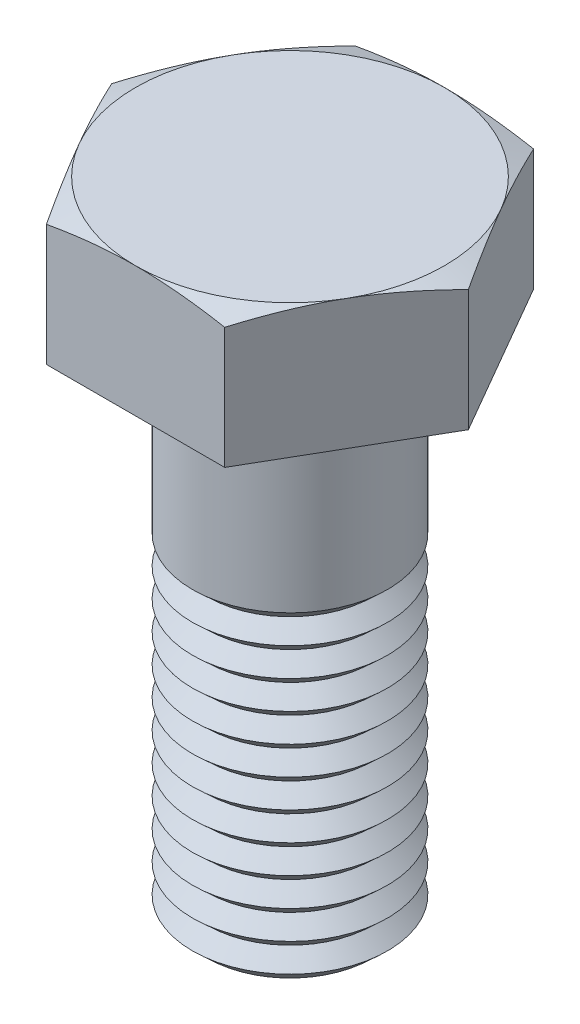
ISO-10303-21;
HEADER;
FILE_DESCRIPTION(('STEP AP214'),'2;1');
FILE_NAME('part.step','',(''),(''),'','','');
FILE_SCHEMA(('AUTOMOTIVE_DESIGN { 1 0 10303 214 1 1 1 1 }'));
ENDSEC;
DATA;
#1=APPLICATION_CONTEXT('core data for automotive mechanical design processes');
#2=APPLICATION_PROTOCOL_DEFINITION('international standard','automotive_design',2000,#1);
#3=PRODUCT_CONTEXT('',#1,'mechanical');
#4=PRODUCT('Part','Part','',(#3));
#5=PRODUCT_RELATED_PRODUCT_CATEGORY('part','',(#4));
#6=PRODUCT_DEFINITION_FORMATION('','',#4);
#7=PRODUCT_DEFINITION_CONTEXT('part definition',#1,'design');
#8=PRODUCT_DEFINITION('design','',#6,#7);
#9=PRODUCT_DEFINITION_SHAPE('','',#8);
#10=(LENGTH_UNIT() NAMED_UNIT(*) SI_UNIT(.MILLI.,.METRE.));
#11=(NAMED_UNIT(*) PLANE_ANGLE_UNIT() SI_UNIT($,.RADIAN.));
#12=(NAMED_UNIT(*) SI_UNIT($,.STERADIAN.) SOLID_ANGLE_UNIT());
#13=UNCERTAINTY_MEASURE_WITH_UNIT(LENGTH_MEASURE(1.E-05),#10,'distance_accuracy_value','');
#14=(GEOMETRIC_REPRESENTATION_CONTEXT(3) GLOBAL_UNCERTAINTY_ASSIGNED_CONTEXT((#13)) GLOBAL_UNIT_ASSIGNED_CONTEXT((#10,
#11,#12)) REPRESENTATION_CONTEXT('',''));
#15=CARTESIAN_POINT('',(0.,0.,0.));
#16=DIRECTION('',(0.,0.,1.));
#17=DIRECTION('',(1.,0.,0.));
#18=AXIS2_PLACEMENT_3D('',#15,#16,#17);
#19=CARTESIAN_POINT('',(16.4544826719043,-8.,-9.5));
#20=DIRECTION('',(0.,1.,0.));
#21=DIRECTION('',(0.,0.,1.));
#22=AXIS2_PLACEMENT_3D('',#19,#20,#21);
#23=PLANE('',#22);
#24=DIRECTION('',(0.5,0.,-0.866025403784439));
#25=VECTOR('',#24,1.);
#26=CARTESIAN_POINT('',(5.48482755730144,-8.,9.5));
#27=LINE('',#26,#25);
#28=CARTESIAN_POINT('',(5.48482755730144,-8.,9.5));
#29=VERTEX_POINT('',#28);
#30=CARTESIAN_POINT('',(10.9696551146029,-8.,0.));
#31=VERTEX_POINT('',#30);
#32=EDGE_CURVE('E165',#29,#31,#27,.T.);
#33=ORIENTED_EDGE('',*,*,#32,.F.);
#34=DIRECTION('',(1.,0.,0.));
#35=VECTOR('',#34,1.);
#36=CARTESIAN_POINT('',(-5.48482755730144,-8.,9.5));
#37=LINE('',#36,#35);
#38=CARTESIAN_POINT('',(-5.48482755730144,-8.,9.5));
#39=VERTEX_POINT('',#38);
#40=EDGE_CURVE('E180',#39,#29,#37,.T.);
#41=ORIENTED_EDGE('',*,*,#40,.F.);
#42=DIRECTION('',(0.5,0.,0.866025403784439));
#43=VECTOR('',#42,1.);
#44=CARTESIAN_POINT('',(-10.9696551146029,-8.,0.));
#45=LINE('',#44,#43);
#46=CARTESIAN_POINT('',(-10.9696551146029,-8.,0.));
#47=VERTEX_POINT('',#46);
#48=EDGE_CURVE('E177',#47,#39,#45,.T.);
#49=ORIENTED_EDGE('',*,*,#48,.F.);
#50=DIRECTION('',(-0.5,0.,0.866025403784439));
#51=VECTOR('',#50,1.);
#52=CARTESIAN_POINT('',(-5.48482755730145,-8.,-9.5));
#53=LINE('',#52,#51);
#54=CARTESIAN_POINT('',(-5.48482755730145,-8.,-9.5));
#55=VERTEX_POINT('',#54);
#56=EDGE_CURVE('E174',#55,#47,#53,.T.);
#57=ORIENTED_EDGE('',*,*,#56,.F.);
#58=DIRECTION('',(-1.,0.,0.));
#59=VECTOR('',#58,1.);
#60=CARTESIAN_POINT('',(5.48482755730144,-8.,-9.5));
#61=LINE('',#60,#59);
#62=CARTESIAN_POINT('',(5.48482755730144,-8.,-9.5));
#63=VERTEX_POINT('',#62);
#64=EDGE_CURVE('E171',#63,#55,#61,.T.);
#65=ORIENTED_EDGE('',*,*,#64,.F.);
#66=DIRECTION('',(-0.5,0.,-0.866025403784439));
#67=VECTOR('',#66,1.);
#68=CARTESIAN_POINT('',(10.9696551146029,-8.,0.));
#69=LINE('',#68,#67);
#70=EDGE_CURVE('E168',#31,#63,#69,.T.);
#71=ORIENTED_EDGE('',*,*,#70,.F.);
#72=EDGE_LOOP('',(#33,#41,#49,#57,#65,#71));
#73=FACE_BOUND('',#72,.T.);
#74=CARTESIAN_POINT('',(0.,-8.,0.));
#75=DIRECTION('',(0.,1.,0.));
#76=DIRECTION('',(0.,0.,1.));
#77=AXIS2_PLACEMENT_3D('',#74,#75,#76);
#78=CIRCLE('',#77,6.);
#79=CARTESIAN_POINT('',(0.,-8.,6.));
#80=VERTEX_POINT('',#79);
#81=EDGE_CURVE('E11',#80,#80,#78,.F.);
#82=ORIENTED_EDGE('',*,*,#81,.F.);
#83=EDGE_LOOP('',(#82));
#84=FACE_BOUND('',#83,.T.);
#85=ADVANCED_FACE('F33',(#73,#84),#23,.F.);
#86=CARTESIAN_POINT('',(5.48482755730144,-8.,9.5));
#87=DIRECTION('',(0.866025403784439,0.,0.5));
#88=DIRECTION('',(0.5,0.,-0.866025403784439));
#89=AXIS2_PLACEMENT_3D('',#86,#87,#88);
#90=PLANE('',#89);
#91=CARTESIAN_POINT('',(5.48471208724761,-0.53495274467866,9.5002));
#92=CARTESIAN_POINT('',(5.71186037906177,-0.452247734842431,9.10676761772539));
#93=CARTESIAN_POINT('',(5.93975769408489,-0.377013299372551,8.71203788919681));
#94=CARTESIAN_POINT('',(6.39703409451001,-0.244650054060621,7.9200119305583));
#95=CARTESIAN_POINT('',(6.62641419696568,-0.187535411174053,7.52271393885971));
#96=CARTESIAN_POINT('',(7.08411065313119,-0.0951541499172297,6.72996042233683));
#97=CARTESIAN_POINT('',(7.31241655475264,-0.059686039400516,6.33452300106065));
#98=CARTESIAN_POINT('',(7.76956223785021,-0.0121133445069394,5.54272345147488));
#99=CARTESIAN_POINT('',(7.99840178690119,0.,5.14636172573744));
#100=CARTESIAN_POINT('',(8.45608088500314,0.,4.35363827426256));
#101=CARTESIAN_POINT('',(8.68492043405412,-0.0121133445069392,3.95727654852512));
#102=CARTESIAN_POINT('',(9.14206611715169,-0.0596860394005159,3.16547699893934));
#103=CARTESIAN_POINT('',(9.37037201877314,-0.09515414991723,2.77003957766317));
#104=CARTESIAN_POINT('',(9.82806847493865,-0.187535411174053,1.97728606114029));
#105=CARTESIAN_POINT('',(10.0574485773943,-0.244650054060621,1.5799880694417));
#106=CARTESIAN_POINT('',(10.5147249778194,-0.377013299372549,0.787962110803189));
#107=CARTESIAN_POINT('',(10.7426222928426,-0.452247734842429,0.393232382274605));
#108=CARTESIAN_POINT('',(10.9697705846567,-0.534952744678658,-0.000200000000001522));
#109=B_SPLINE_CURVE_WITH_KNOTS('',3,(#91,#92,#93,#94,#95,#96,#97,#98,#99,#100,#101,#102,#103,
#104,#105,#106,#107,#108),.UNSPECIFIED.,.F.,.F.,(4,2,2,2,2,2,2,2,4),(0.,1.38543330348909,
2.7719471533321,4.14534984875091,5.51823729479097,6.89112474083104,8.26452743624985,
9.65104128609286,11.0364745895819),.UNSPECIFIED.);
#110=CARTESIAN_POINT('',(5.48482755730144,-0.534910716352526,9.5));
#111=VERTEX_POINT('',#110);
#112=CARTESIAN_POINT('',(8.22724133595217,0.,4.75));
#113=VERTEX_POINT('',#112);
#114=EDGE_CURVE('E223',#111,#113,#109,.T.);
#115=ORIENTED_EDGE('',*,*,#114,.F.);
#116=DIRECTION('',(0.,1.,0.));
#117=VECTOR('',#116,1.);
#118=CARTESIAN_POINT('',(5.48482755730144,-8.,9.5));
#119=LINE('',#118,#117);
#120=EDGE_CURVE('E184',#29,#111,#119,.T.);
#121=ORIENTED_EDGE('',*,*,#120,.F.);
#122=ORIENTED_EDGE('',*,*,#32,.T.);
#123=DIRECTION('',(0.,1.,0.));
#124=VECTOR('',#123,1.);
#125=CARTESIAN_POINT('',(10.9696551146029,-8.,0.));
#126=LINE('',#125,#124);
#127=CARTESIAN_POINT('',(10.9696551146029,-0.534910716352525,0.));
#128=VERTEX_POINT('',#127);
#129=EDGE_CURVE('E183',#31,#128,#126,.T.);
#130=ORIENTED_EDGE('',*,*,#129,.T.);
#131=EDGE_CURVE('E225',#113,#128,#109,.T.);
#132=ORIENTED_EDGE('',*,*,#131,.F.);
#133=EDGE_LOOP('',(#115,#121,#122,#130,#132));
#134=FACE_BOUND('',#133,.T.);
#135=ADVANCED_FACE('F35',(#134),#90,.T.);
#136=CARTESIAN_POINT('',(-5.48482755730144,-8.,9.5));
#137=DIRECTION('',(0.,0.,1.));
#138=DIRECTION('',(1.,0.,0.));
#139=AXIS2_PLACEMENT_3D('',#136,#137,#138);
#140=PLANE('',#139);
#141=CARTESIAN_POINT('',(-14.5419416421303,-2.86445796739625,9.5));
#142=CARTESIAN_POINT('',(-14.111908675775,-2.73345890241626,9.5));
#143=CARTESIAN_POINT('',(-13.6814027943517,-2.60398402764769,9.5));
#144=CARTESIAN_POINT('',(-12.8192043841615,-2.34892580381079,9.5));
#145=CARTESIAN_POINT('',(-12.387511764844,-2.22334276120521,9.5));
#146=CARTESIAN_POINT('',(-11.521965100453,-1.97670381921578,9.5));
#147=CARTESIAN_POINT('',(-11.0881085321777,-1.85565674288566,9.5));
#148=CARTESIAN_POINT('',(-10.2187842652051,-1.61950158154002,9.5));
#149=CARTESIAN_POINT('',(-9.78331659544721,-1.50439339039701,9.5));
#150=CARTESIAN_POINT('',(-8.91584902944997,-1.28295767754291,9.5));
#151=CARTESIAN_POINT('',(-8.48387237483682,-1.17653955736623,9.5));
#152=CARTESIAN_POINT('',(-7.6177717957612,-0.972733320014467,9.5));
#153=CARTESIAN_POINT('',(-7.18364783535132,-0.875345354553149,9.5));
#154=CARTESIAN_POINT('',(-6.31315143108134,-0.691863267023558,9.5));
#155=CARTESIAN_POINT('',(-5.87677978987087,-0.605765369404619,9.5));
#156=CARTESIAN_POINT('',(-5.00150208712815,-0.44747954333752,9.5));
#157=CARTESIAN_POINT('',(-4.56259611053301,-0.375291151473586,9.5));
#158=CARTESIAN_POINT('',(-3.73163054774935,-0.254897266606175,9.5));
#159=CARTESIAN_POINT('',(-3.33983139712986,-0.204910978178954,9.5));
#160=CARTESIAN_POINT('',(-2.55457029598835,-0.120228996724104,9.5));
#161=CARTESIAN_POINT('',(-2.16110839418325,-0.0855328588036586,9.5));
#162=CARTESIAN_POINT('',(-1.37332015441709,-0.0331017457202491,9.5));
#163=CARTESIAN_POINT('',(-0.978994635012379,-0.015354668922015,9.5));
#164=CARTESIAN_POINT('',(-0.189940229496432,0.00227934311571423,9.5));
#165=CARTESIAN_POINT('',(0.204788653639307,0.00216640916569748,9.5));
#166=CARTESIAN_POINT('',(0.99583170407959,-0.0159594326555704,9.5));
#167=CARTESIAN_POINT('',(1.3921437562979,-0.0340631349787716,9.5));
#168=CARTESIAN_POINT('',(2.18360912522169,-0.087337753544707,9.5));
#169=CARTESIAN_POINT('',(2.57876241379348,-0.122509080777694,9.5));
#170=CARTESIAN_POINT('',(3.36771357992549,-0.208269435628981,9.5));
#171=CARTESIAN_POINT('',(3.76150999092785,-0.25887176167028,9.5));
#172=CARTESIAN_POINT('',(4.5471326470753,-0.373435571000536,9.5));
#173=CARTESIAN_POINT('',(4.93895888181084,-0.437397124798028,9.5));
#174=CARTESIAN_POINT('',(5.74225885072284,-0.580450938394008,9.5));
#175=CARTESIAN_POINT('',(6.15361717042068,-0.660185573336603,9.5));
#176=CARTESIAN_POINT('',(6.97421437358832,-0.829964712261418,9.5));
#177=CARTESIAN_POINT('',(7.38345309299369,-0.920010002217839,9.5));
#178=CARTESIAN_POINT('',(8.20010488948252,-1.10850683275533,9.5));
#179=CARTESIAN_POINT('',(8.60751739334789,-1.20696084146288,9.5));
#180=CARTESIAN_POINT('',(9.4206212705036,-1.4106638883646,9.5));
#181=CARTESIAN_POINT('',(9.82631268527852,-1.51591276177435,9.5));
#182=CARTESIAN_POINT('',(10.6367432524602,-1.73207211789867,9.5));
#183=CARTESIAN_POINT('',(11.041480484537,-1.84298977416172,9.5));
#184=CARTESIAN_POINT('',(11.8496881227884,-2.06934217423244,9.5));
#185=CARTESIAN_POINT('',(12.253158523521,-2.18477693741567,9.5));
#186=CARTESIAN_POINT('',(13.0589479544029,-2.41933287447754,9.5));
#187=CARTESIAN_POINT('',(13.4612671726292,-2.53845340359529,9.5));
#188=CARTESIAN_POINT('',(14.2649852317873,-2.77976340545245,9.5));
#189=CARTESIAN_POINT('',(14.6663840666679,-2.90195289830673,9.5));
#190=CARTESIAN_POINT('',(15.8605690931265,-3.26960931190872,9.5));
#191=CARTESIAN_POINT('',(16.6522166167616,-3.51877398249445,9.5));
#192=CARTESIAN_POINT('',(18.2332882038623,-4.02415555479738,9.5));
#193=CARTESIAN_POINT('',(19.0227121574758,-4.28037279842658,9.5));
#194=CARTESIAN_POINT('',(20.5968461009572,-4.79698600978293,9.5));
#195=CARTESIAN_POINT('',(21.3815625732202,-5.05736225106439,9.5));
#196=CARTESIAN_POINT('',(22.5576353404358,-5.45080826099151,9.5));
#197=CARTESIAN_POINT('',(22.9494767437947,-5.58243181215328,9.5));
#198=CARTESIAN_POINT('',(23.7328721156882,-5.8465285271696,9.5));
#199=CARTESIAN_POINT('',(24.1244260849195,-5.9790016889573,9.5));
#200=CARTESIAN_POINT('',(24.5158552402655,-6.11184281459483,9.5));
#201=B_SPLINE_CURVE_WITH_KNOTS('',3,(#141,#142,#143,#144,#145,#146,#147,#148,#149,#150,#151,
#152,#153,#154,#155,#156,#157,#158,#159,#160,#161,#162,#163,#164,#165,#166,#167,#168,#169,#170,
#171,#172,#173,#174,#175,#176,#177,#178,#179,#180,#181,#182,#183,#184,#185,#186,#187,#188,#189,
#190,#191,#192,#193,#194,#195,#196,#197,#198,#199,#200),.UNSPECIFIED.,.F.,.F.,(4,2,2,2,2,2,2,2,
2,2,2,2,2,2,2,2,2,2,2,2,2,2,2,2,2,2,2,2,2,4),(0.,1.34863916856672,2.69738426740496,
4.04862941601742,5.39985040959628,6.73444889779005,8.06906980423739,9.40324325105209,
10.7373722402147,11.9220374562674,13.1066682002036,14.2904524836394,15.4742280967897,
16.6640083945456,17.8538173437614,19.0446545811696,20.2354981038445,21.4923798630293,
22.7493574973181,24.0067053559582,25.2640227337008,26.5229726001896,27.7819278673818,
29.0406641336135,30.2994086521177,32.789153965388,35.2790201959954,37.7593650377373,
38.9994369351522,40.2395058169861),.UNSPECIFIED.);
#202=CARTESIAN_POINT('',(-5.48482755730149,-0.534910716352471,9.5));
#203=VERTEX_POINT('',#202);
#204=CARTESIAN_POINT('',(0.,0.,9.5));
#205=VERTEX_POINT('',#204);
#206=EDGE_CURVE('E154',#203,#205,#201,.T.);
#207=ORIENTED_EDGE('',*,*,#206,.F.);
#208=DIRECTION('',(0.,1.,0.));
#209=VECTOR('',#208,1.);
#210=CARTESIAN_POINT('',(-5.48482755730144,-8.,9.5));
#211=LINE('',#210,#209);
#212=EDGE_CURVE('E188',#39,#203,#211,.T.);
#213=ORIENTED_EDGE('',*,*,#212,.F.);
#214=ORIENTED_EDGE('',*,*,#40,.T.);
#215=ORIENTED_EDGE('',*,*,#120,.T.);
#216=EDGE_CURVE('E148',#205,#111,#201,.T.);
#217=ORIENTED_EDGE('',*,*,#216,.F.);
#218=EDGE_LOOP('',(#207,#213,#214,#215,#217));
#219=FACE_BOUND('',#218,.T.);
#220=ADVANCED_FACE('F125',(#219),#140,.T.);
#221=CARTESIAN_POINT('',(-10.9696551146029,-8.,0.));
#222=DIRECTION('',(-0.866025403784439,0.,0.5));
#223=DIRECTION('',(0.5,0.,0.866025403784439));
#224=AXIS2_PLACEMENT_3D('',#221,#222,#223);
#225=PLANE('',#224);
#226=CARTESIAN_POINT('',(-10.9697705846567,-0.534952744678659,-0.000199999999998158));
#227=CARTESIAN_POINT('',(-10.7426222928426,-0.45224773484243,0.393232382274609));
#228=CARTESIAN_POINT('',(-10.5147249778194,-0.37701329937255,0.787962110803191));
#229=CARTESIAN_POINT('',(-10.0574485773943,-0.244650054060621,1.5799880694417));
#230=CARTESIAN_POINT('',(-9.82806847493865,-0.187535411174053,1.97728606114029));
#231=CARTESIAN_POINT('',(-9.37037201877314,-0.0951541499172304,2.77003957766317));
#232=CARTESIAN_POINT('',(-9.14206611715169,-0.0596860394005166,3.16547699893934));
#233=CARTESIAN_POINT('',(-8.68492043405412,-0.01211334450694,3.95727654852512));
#234=CARTESIAN_POINT('',(-8.45608088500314,0.,4.35363827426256));
#235=CARTESIAN_POINT('',(-7.99840178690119,0.,5.14636172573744));
#236=CARTESIAN_POINT('',(-7.76956223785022,-0.01211334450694,5.54272345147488));
#237=CARTESIAN_POINT('',(-7.31241655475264,-0.0596860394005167,6.33452300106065));
#238=CARTESIAN_POINT('',(-7.08411065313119,-0.0951541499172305,6.72996042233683));
#239=CARTESIAN_POINT('',(-6.62641419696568,-0.187535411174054,7.52271393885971));
#240=CARTESIAN_POINT('',(-6.39703409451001,-0.244650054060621,7.9200119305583));
#241=CARTESIAN_POINT('',(-5.93975769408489,-0.37701329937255,8.71203788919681));
#242=CARTESIAN_POINT('',(-5.71186037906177,-0.45224773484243,9.10676761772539));
#243=CARTESIAN_POINT('',(-5.48471208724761,-0.534952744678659,9.5002));
#244=B_SPLINE_CURVE_WITH_KNOTS('',3,(#226,#227,#228,#229,#230,#231,#232,#233,#234,#235,#236,
#237,#238,#239,#240,#241,#242,#243),.UNSPECIFIED.,.F.,.F.,(4,2,2,2,2,2,2,2,4),(0.,
1.38543330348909,2.7719471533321,4.14534984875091,5.51823729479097,6.89112474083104,
8.26452743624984,9.65104128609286,11.0364745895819),.UNSPECIFIED.);
#245=CARTESIAN_POINT('',(-10.9696551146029,-0.534910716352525,0.));
#246=VERTEX_POINT('',#245);
#247=CARTESIAN_POINT('',(-8.22724133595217,0.,4.75));
#248=VERTEX_POINT('',#247);
#249=EDGE_CURVE('E49',#246,#248,#244,.T.);
#250=ORIENTED_EDGE('',*,*,#249,.F.);
#251=DIRECTION('',(0.,1.,0.));
#252=VECTOR('',#251,1.);
#253=CARTESIAN_POINT('',(-10.9696551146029,-8.,0.));
#254=LINE('',#253,#252);
#255=EDGE_CURVE('E191',#47,#246,#254,.T.);
#256=ORIENTED_EDGE('',*,*,#255,.F.);
#257=ORIENTED_EDGE('',*,*,#48,.T.);
#258=ORIENTED_EDGE('',*,*,#212,.T.);
#259=EDGE_CURVE('E159',#248,#203,#244,.T.);
#260=ORIENTED_EDGE('',*,*,#259,.F.);
#261=EDGE_LOOP('',(#250,#256,#257,#258,#260));
#262=FACE_BOUND('',#261,.T.);
#263=ADVANCED_FACE('F143',(#262),#225,.T.);
#264=CARTESIAN_POINT('',(-5.48482755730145,-8.,-9.5));
#265=DIRECTION('',(-0.866025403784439,0.,-0.5));
#266=DIRECTION('',(-0.5,0.,0.866025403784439));
#267=AXIS2_PLACEMENT_3D('',#264,#265,#266);
#268=PLANE('',#267);
#269=CARTESIAN_POINT('',(-5.48471208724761,-0.53495274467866,-9.5002));
#270=CARTESIAN_POINT('',(-5.71186037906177,-0.452247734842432,-9.1067676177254));
#271=CARTESIAN_POINT('',(-5.93975769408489,-0.377013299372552,-8.71203788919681));
#272=CARTESIAN_POINT('',(-6.39703409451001,-0.244650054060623,-7.9200119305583));
#273=CARTESIAN_POINT('',(-6.62641419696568,-0.187535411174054,-7.52271393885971));
#274=CARTESIAN_POINT('',(-7.08411065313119,-0.095154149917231,-6.72996042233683));
#275=CARTESIAN_POINT('',(-7.31241655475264,-0.0596860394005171,-6.33452300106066));
#276=CARTESIAN_POINT('',(-7.76956223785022,-0.0121133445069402,-5.54272345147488));
#277=CARTESIAN_POINT('',(-7.99840178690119,0.,-5.14636172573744));
#278=CARTESIAN_POINT('',(-8.45608088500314,0.,-4.35363827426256));
#279=CARTESIAN_POINT('',(-8.68492043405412,-0.0121133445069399,-3.95727654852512));
#280=CARTESIAN_POINT('',(-9.14206611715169,-0.0596860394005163,-3.16547699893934));
#281=CARTESIAN_POINT('',(-9.37037201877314,-0.0951541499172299,-2.77003957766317));
#282=CARTESIAN_POINT('',(-9.82806847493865,-0.187535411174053,-1.97728606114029));
#283=CARTESIAN_POINT('',(-10.0574485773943,-0.244650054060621,-1.5799880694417));
#284=CARTESIAN_POINT('',(-10.5147249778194,-0.37701329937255,-0.787962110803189));
#285=CARTESIAN_POINT('',(-10.7426222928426,-0.45224773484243,-0.393232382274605));
#286=CARTESIAN_POINT('',(-10.9697705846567,-0.534952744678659,0.000200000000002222));
#287=B_SPLINE_CURVE_WITH_KNOTS('',3,(#269,#270,#271,#272,#273,#274,#275,#276,#277,#278,#279,
#280,#281,#282,#283,#284,#285,#286),.UNSPECIFIED.,.F.,.F.,(4,2,2,2,2,2,2,2,4),(0.,
1.38543330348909,2.7719471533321,4.14534984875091,5.51823729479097,6.89112474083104,
8.26452743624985,9.65104128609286,11.036474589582),.UNSPECIFIED.);
#288=CARTESIAN_POINT('',(-5.48482755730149,-0.534910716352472,-9.5));
#289=VERTEX_POINT('',#288);
#290=CARTESIAN_POINT('',(-8.22724133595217,0.,-4.75));
#291=VERTEX_POINT('',#290);
#292=EDGE_CURVE('E57',#289,#291,#287,.T.);
#293=ORIENTED_EDGE('',*,*,#292,.F.);
#294=DIRECTION('',(0.,1.,0.));
#295=VECTOR('',#294,1.);
#296=CARTESIAN_POINT('',(-5.48482755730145,-8.,-9.5));
#297=LINE('',#296,#295);
#298=EDGE_CURVE('E194',#55,#289,#297,.T.);
#299=ORIENTED_EDGE('',*,*,#298,.F.);
#300=ORIENTED_EDGE('',*,*,#56,.T.);
#301=ORIENTED_EDGE('',*,*,#255,.T.);
#302=EDGE_CURVE('E164',#291,#246,#287,.T.);
#303=ORIENTED_EDGE('',*,*,#302,.F.);
#304=EDGE_LOOP('',(#293,#299,#300,#301,#303));
#305=FACE_BOUND('',#304,.T.);
#306=ADVANCED_FACE('F248',(#305),#268,.T.);
#307=CARTESIAN_POINT('',(5.48482755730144,-8.,-9.5));
#308=DIRECTION('',(0.,0.,-1.));
#309=DIRECTION('',(-1.,0.,0.));
#310=AXIS2_PLACEMENT_3D('',#307,#308,#309);
#311=PLANE('',#310);
#312=CARTESIAN_POINT('',(-14.5419416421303,-2.86445796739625,-9.5));
#313=CARTESIAN_POINT('',(-14.111908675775,-2.73345890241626,-9.5));
#314=CARTESIAN_POINT('',(-13.6814027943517,-2.60398402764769,-9.5));
#315=CARTESIAN_POINT('',(-12.8192043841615,-2.34892580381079,-9.5));
#316=CARTESIAN_POINT('',(-12.387511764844,-2.22334276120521,-9.5));
#317=CARTESIAN_POINT('',(-11.521965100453,-1.97670381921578,-9.5));
#318=CARTESIAN_POINT('',(-11.0881085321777,-1.85565674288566,-9.5));
#319=CARTESIAN_POINT('',(-10.2187842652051,-1.61950158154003,-9.5));
#320=CARTESIAN_POINT('',(-9.78331659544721,-1.50439339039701,-9.5));
#321=CARTESIAN_POINT('',(-8.91584902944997,-1.28295767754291,-9.5));
#322=CARTESIAN_POINT('',(-8.48387237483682,-1.17653955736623,-9.5));
#323=CARTESIAN_POINT('',(-7.61777179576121,-0.972733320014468,-9.5));
#324=CARTESIAN_POINT('',(-7.18364783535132,-0.875345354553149,-9.5));
#325=CARTESIAN_POINT('',(-6.31315143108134,-0.691863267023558,-9.5));
#326=CARTESIAN_POINT('',(-5.87677978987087,-0.60576536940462,-9.5));
#327=CARTESIAN_POINT('',(-5.00150208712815,-0.447479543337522,-9.5));
#328=CARTESIAN_POINT('',(-4.56259611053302,-0.375291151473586,-9.5));
#329=CARTESIAN_POINT('',(-3.73163054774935,-0.254897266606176,-9.5));
#330=CARTESIAN_POINT('',(-3.33983139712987,-0.204910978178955,-9.5));
#331=CARTESIAN_POINT('',(-2.55457029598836,-0.120228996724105,-9.5));
#332=CARTESIAN_POINT('',(-2.16110839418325,-0.0855328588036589,-9.5));
#333=CARTESIAN_POINT('',(-1.37332015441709,-0.0331017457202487,-9.5));
#334=CARTESIAN_POINT('',(-0.978994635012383,-0.0153546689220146,-9.5));
#335=CARTESIAN_POINT('',(-0.189940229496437,0.00227934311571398,-9.5));
#336=CARTESIAN_POINT('',(0.204788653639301,0.00216640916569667,-9.5));
#337=CARTESIAN_POINT('',(0.995831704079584,-0.0159594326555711,-9.5));
#338=CARTESIAN_POINT('',(1.3921437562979,-0.0340631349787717,-9.5));
#339=CARTESIAN_POINT('',(2.18360912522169,-0.0873377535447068,-9.5));
#340=CARTESIAN_POINT('',(2.57876241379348,-0.122509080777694,-9.5));
#341=CARTESIAN_POINT('',(3.36771357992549,-0.208269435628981,-9.5));
#342=CARTESIAN_POINT('',(3.76150999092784,-0.25887176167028,-9.5));
#343=CARTESIAN_POINT('',(4.5471326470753,-0.373435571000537,-9.5));
#344=CARTESIAN_POINT('',(4.93895888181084,-0.437397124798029,-9.5));
#345=CARTESIAN_POINT('',(5.74225885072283,-0.580450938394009,-9.5));
#346=CARTESIAN_POINT('',(6.15361717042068,-0.660185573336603,-9.5));
#347=CARTESIAN_POINT('',(6.97421437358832,-0.829964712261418,-9.5));
#348=CARTESIAN_POINT('',(7.38345309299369,-0.92001000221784,-9.5));
#349=CARTESIAN_POINT('',(8.20010488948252,-1.10850683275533,-9.5));
#350=CARTESIAN_POINT('',(8.60751739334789,-1.20696084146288,-9.5));
#351=CARTESIAN_POINT('',(9.4206212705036,-1.4106638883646,-9.5));
#352=CARTESIAN_POINT('',(9.82631268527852,-1.51591276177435,-9.5));
#353=CARTESIAN_POINT('',(10.6367432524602,-1.73207211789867,-9.5));
#354=CARTESIAN_POINT('',(11.041480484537,-1.84298977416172,-9.5));
#355=CARTESIAN_POINT('',(11.8496881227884,-2.06934217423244,-9.5));
#356=CARTESIAN_POINT('',(12.253158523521,-2.18477693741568,-9.5));
#357=CARTESIAN_POINT('',(13.0589479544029,-2.41933287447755,-9.5));
#358=CARTESIAN_POINT('',(13.4612671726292,-2.53845340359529,-9.5));
#359=CARTESIAN_POINT('',(14.2649852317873,-2.77976340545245,-9.5));
#360=CARTESIAN_POINT('',(14.6663840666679,-2.90195289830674,-9.5));
#361=CARTESIAN_POINT('',(15.8605690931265,-3.26960931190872,-9.5));
#362=CARTESIAN_POINT('',(16.6522166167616,-3.51877398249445,-9.5));
#363=CARTESIAN_POINT('',(18.2332882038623,-4.02415555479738,-9.5));
#364=CARTESIAN_POINT('',(19.0227121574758,-4.28037279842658,-9.5));
#365=CARTESIAN_POINT('',(20.5968461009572,-4.79698600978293,-9.5));
#366=CARTESIAN_POINT('',(21.3815625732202,-5.05736225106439,-9.5));
#367=CARTESIAN_POINT('',(22.5576353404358,-5.4508082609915,-9.5));
#368=CARTESIAN_POINT('',(22.9494767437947,-5.58243181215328,-9.5));
#369=CARTESIAN_POINT('',(23.7328721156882,-5.8465285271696,-9.5));
#370=CARTESIAN_POINT('',(24.1244260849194,-5.9790016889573,-9.5));
#371=CARTESIAN_POINT('',(24.5158552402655,-6.11184281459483,-9.5));
#372=B_SPLINE_CURVE_WITH_KNOTS('',3,(#312,#313,#314,#315,#316,#317,#318,#319,#320,#321,#322,
#323,#324,#325,#326,#327,#328,#329,#330,#331,#332,#333,#334,#335,#336,#337,#338,#339,#340,#341,
#342,#343,#344,#345,#346,#347,#348,#349,#350,#351,#352,#353,#354,#355,#356,#357,#358,#359,#360,
#361,#362,#363,#364,#365,#366,#367,#368,#369,#370,#371),.UNSPECIFIED.,.F.,.F.,(4,2,2,2,2,2,2,2,
2,2,2,2,2,2,2,2,2,2,2,2,2,2,2,2,2,2,2,2,2,4),(0.,1.34863916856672,2.69738426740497,
4.04862941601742,5.39985040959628,6.73444889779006,8.0690698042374,9.40324325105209,
10.7373722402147,11.9220374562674,13.1066682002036,14.2904524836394,15.4742280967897,
16.6640083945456,17.8538173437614,19.0446545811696,20.2354981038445,21.4923798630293,
22.7493574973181,24.0067053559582,25.2640227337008,26.5229726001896,27.7819278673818,
29.0406641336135,30.2994086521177,32.789153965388,35.2790201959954,37.7593650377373,
38.9994369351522,40.2395058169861),.UNSPECIFIED.);
#373=CARTESIAN_POINT('',(5.48482755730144,-0.534910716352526,-9.5));
#374=VERTEX_POINT('',#373);
#375=CARTESIAN_POINT('',(0.,0.,-9.5));
#376=VERTEX_POINT('',#375);
#377=EDGE_CURVE('E222',#374,#376,#372,.F.);
#378=ORIENTED_EDGE('',*,*,#377,.F.);
#379=DIRECTION('',(0.,1.,0.));
#380=VECTOR('',#379,1.);
#381=CARTESIAN_POINT('',(5.48482755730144,-8.,-9.5));
#382=LINE('',#381,#380);
#383=EDGE_CURVE('E197',#63,#374,#382,.T.);
#384=ORIENTED_EDGE('',*,*,#383,.F.);
#385=ORIENTED_EDGE('',*,*,#64,.T.);
#386=ORIENTED_EDGE('',*,*,#298,.T.);
#387=EDGE_CURVE('E216',#376,#289,#372,.F.);
#388=ORIENTED_EDGE('',*,*,#387,.F.);
#389=EDGE_LOOP('',(#378,#384,#385,#386,#388));
#390=FACE_BOUND('',#389,.T.);
#391=ADVANCED_FACE('F221',(#390),#311,.T.);
#392=CARTESIAN_POINT('',(10.9696551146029,-8.,0.));
#393=DIRECTION('',(0.866025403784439,0.,-0.5));
#394=DIRECTION('',(-0.5,0.,-0.866025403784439));
#395=AXIS2_PLACEMENT_3D('',#392,#393,#394);
#396=PLANE('',#395);
#397=CARTESIAN_POINT('',(10.9697705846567,-0.534952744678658,0.000199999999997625));
#398=CARTESIAN_POINT('',(10.7426222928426,-0.45224773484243,-0.393232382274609));
#399=CARTESIAN_POINT('',(10.5147249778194,-0.37701329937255,-0.787962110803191));
#400=CARTESIAN_POINT('',(10.0574485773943,-0.244650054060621,-1.5799880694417));
#401=CARTESIAN_POINT('',(9.82806847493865,-0.187535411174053,-1.97728606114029));
#402=CARTESIAN_POINT('',(9.37037201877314,-0.0951541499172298,-2.77003957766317));
#403=CARTESIAN_POINT('',(9.14206611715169,-0.0596860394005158,-3.16547699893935));
#404=CARTESIAN_POINT('',(8.68492043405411,-0.0121133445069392,-3.95727654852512));
#405=CARTESIAN_POINT('',(8.45608088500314,0.,-4.35363827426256));
#406=CARTESIAN_POINT('',(7.99840178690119,0.,-5.14636172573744));
#407=CARTESIAN_POINT('',(7.76956223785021,-0.0121133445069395,-5.54272345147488));
#408=CARTESIAN_POINT('',(7.31241655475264,-0.0596860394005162,-6.33452300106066));
#409=CARTESIAN_POINT('',(7.08411065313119,-0.0951541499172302,-6.72996042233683));
#410=CARTESIAN_POINT('',(6.62641419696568,-0.187535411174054,-7.52271393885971));
#411=CARTESIAN_POINT('',(6.39703409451,-0.244650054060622,-7.9200119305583));
#412=CARTESIAN_POINT('',(5.93975769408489,-0.37701329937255,-8.71203788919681));
#413=CARTESIAN_POINT('',(5.71186037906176,-0.45224773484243,-9.10676761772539));
#414=CARTESIAN_POINT('',(5.4847120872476,-0.534952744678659,-9.5002));
#415=B_SPLINE_CURVE_WITH_KNOTS('',3,(#397,#398,#399,#400,#401,#402,#403,#404,#405,#406,#407,
#408,#409,#410,#411,#412,#413,#414),.UNSPECIFIED.,.F.,.F.,(4,2,2,2,2,2,2,2,4),(0.,
1.38543330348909,2.7719471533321,4.14534984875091,5.51823729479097,6.89112474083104,
8.26452743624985,9.65104128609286,11.0364745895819),.UNSPECIFIED.);
#416=CARTESIAN_POINT('',(8.22724133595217,0.,-4.75));
#417=VERTEX_POINT('',#416);
#418=EDGE_CURVE('E231',#128,#417,#415,.T.);
#419=ORIENTED_EDGE('',*,*,#418,.F.);
#420=ORIENTED_EDGE('',*,*,#129,.F.);
#421=ORIENTED_EDGE('',*,*,#70,.T.);
#422=ORIENTED_EDGE('',*,*,#383,.T.);
#423=EDGE_CURVE('E232',#417,#374,#415,.T.);
#424=ORIENTED_EDGE('',*,*,#423,.F.);
#425=EDGE_LOOP('',(#419,#420,#421,#422,#424));
#426=FACE_BOUND('',#425,.T.);
#427=ADVANCED_FACE('F241',(#426),#396,.T.);
#428=CARTESIAN_POINT('',(0.,-0.745264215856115,0.));
#429=DIRECTION('',(0.,-1.,0.));
#430=DIRECTION('',(0.,0.,-1.));
#431=AXIS2_PLACEMENT_3D('',#428,#429,#430);
#432=CONICAL_SURFACE('',#431,11.5475966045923,1.22173047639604);
#433=ORIENTED_EDGE('',*,*,#216,.T.);
#434=ORIENTED_EDGE('',*,*,#114,.T.);
#435=CARTESIAN_POINT('',(0.,0.,0.));
#436=DIRECTION('',(0.,1.,0.));
#437=DIRECTION('',(0.,0.,1.));
#438=AXIS2_PLACEMENT_3D('',#435,#436,#437);
#439=CIRCLE('',#438,9.5);
#440=EDGE_CURVE('E235',#205,#113,#439,.T.);
#441=ORIENTED_EDGE('',*,*,#440,.F.);
#442=EDGE_LOOP('',(#433,#434,#441));
#443=FACE_BOUND('',#442,.T.);
#444=ADVANCED_FACE('F244',(#443),#432,.T.);
#445=ORIENTED_EDGE('',*,*,#131,.T.);
#446=ORIENTED_EDGE('',*,*,#418,.T.);
#447=CARTESIAN_POINT('',(0.,0.,0.));
#448=DIRECTION('',(0.,1.,0.));
#449=DIRECTION('',(0.,0.,1.));
#450=AXIS2_PLACEMENT_3D('',#447,#448,#449);
#451=CIRCLE('',#450,9.5);
#452=EDGE_CURVE('E187',#417,#113,#451,.F.);
#453=ORIENTED_EDGE('',*,*,#452,.T.);
#454=EDGE_LOOP('',(#445,#446,#453));
#455=FACE_BOUND('',#454,.T.);
#456=ADVANCED_FACE('F269',(#455),#432,.T.);
#457=ORIENTED_EDGE('',*,*,#377,.T.);
#458=EDGE_CURVE('E206',#376,#417,#451,.F.);
#459=ORIENTED_EDGE('',*,*,#458,.T.);
#460=ORIENTED_EDGE('',*,*,#423,.T.);
#461=EDGE_LOOP('',(#457,#459,#460));
#462=FACE_BOUND('',#461,.T.);
#463=ADVANCED_FACE('F131',(#462),#432,.T.);
#464=ORIENTED_EDGE('',*,*,#292,.T.);
#465=EDGE_CURVE('E205',#291,#376,#451,.F.);
#466=ORIENTED_EDGE('',*,*,#465,.T.);
#467=ORIENTED_EDGE('',*,*,#387,.T.);
#468=EDGE_LOOP('',(#464,#466,#467));
#469=FACE_BOUND('',#468,.T.);
#470=ADVANCED_FACE('F214',(#469),#432,.T.);
#471=ORIENTED_EDGE('',*,*,#249,.T.);
#472=EDGE_CURVE('E201',#248,#291,#451,.F.);
#473=ORIENTED_EDGE('',*,*,#472,.T.);
#474=ORIENTED_EDGE('',*,*,#302,.T.);
#475=EDGE_LOOP('',(#471,#473,#474));
#476=FACE_BOUND('',#475,.T.);
#477=ADVANCED_FACE('F275',(#476),#432,.T.);
#478=ORIENTED_EDGE('',*,*,#259,.T.);
#479=ORIENTED_EDGE('',*,*,#206,.T.);
#480=EDGE_CURVE('E42',#205,#248,#451,.F.);
#481=ORIENTED_EDGE('',*,*,#480,.T.);
#482=EDGE_LOOP('',(#478,#479,#481));
#483=FACE_BOUND('',#482,.T.);
#484=ADVANCED_FACE('F138',(#483),#432,.T.);
#485=CARTESIAN_POINT('',(16.4544826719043,0.,-9.5));
#486=DIRECTION('',(0.,1.,0.));
#487=DIRECTION('',(0.,0.,1.));
#488=AXIS2_PLACEMENT_3D('',#485,#486,#487);
#489=PLANE('',#488);
#490=ORIENTED_EDGE('',*,*,#480,.F.);
#491=ORIENTED_EDGE('',*,*,#440,.T.);
#492=ORIENTED_EDGE('',*,*,#452,.F.);
#493=ORIENTED_EDGE('',*,*,#458,.F.);
#494=ORIENTED_EDGE('',*,*,#465,.F.);
#495=ORIENTED_EDGE('',*,*,#472,.F.);
#496=EDGE_LOOP('',(#490,#491,#492,#493,#494,#495));
#497=FACE_BOUND('',#496,.T.);
#498=ADVANCED_FACE('F134',(#497),#489,.T.);
#499=CARTESIAN_POINT('',(0.,0.847372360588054,0.));
#500=DIRECTION('',(0.,1.,0.));
#501=DIRECTION('',(0.,0.,1.));
#502=AXIS2_PLACEMENT_3D('',#499,#500,#501);
#503=CYLINDRICAL_SURFACE('',#502,6.);
#504=ORIENTED_EDGE('',*,*,#81,.T.);
#505=EDGE_LOOP('',(#504));
#506=FACE_BOUND('',#505,.T.);
#507=CARTESIAN_POINT('',(0.,-18.9999999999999,0.));
#508=DIRECTION('',(0.,1.,0.));
#509=DIRECTION('',(0.,0.,1.));
#510=AXIS2_PLACEMENT_3D('',#507,#508,#509);
#511=CIRCLE('',#510,6.);
#512=CARTESIAN_POINT('',(0.,-18.9999999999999,6.));
#513=VERTEX_POINT('',#512);
#514=EDGE_CURVE('E264',#513,#513,#511,.T.);
#515=ORIENTED_EDGE('',*,*,#514,.T.);
#516=EDGE_LOOP('',(#515));
#517=FACE_BOUND('',#516,.T.);
#518=ADVANCED_FACE('F137',(#506,#517),#503,.T.);
#519=CARTESIAN_POINT('',(0.,-19.8749999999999,0.));
#520=DIRECTION('',(0.,1.,0.));
#521=DIRECTION('',(0.,0.,1.));
#522=AXIS2_PLACEMENT_3D('',#519,#520,#521);
#523=CONICAL_SURFACE('',#522,5.053,0.824894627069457);
#524=ORIENTED_EDGE('',*,*,#514,.F.);
#525=EDGE_LOOP('',(#524));
#526=FACE_BOUND('',#525,.T.);
#527=CARTESIAN_POINT('',(0.,-19.8749999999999,0.));
#528=DIRECTION('',(0.,1.,0.));
#529=DIRECTION('',(0.,0.,1.));
#530=AXIS2_PLACEMENT_3D('',#527,#528,#529);
#531=CIRCLE('',#530,5.053);
#532=CARTESIAN_POINT('',(0.,-19.8749999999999,5.053));
#533=VERTEX_POINT('',#532);
#534=EDGE_CURVE('E664',#533,#533,#531,.T.);
#535=ORIENTED_EDGE('',*,*,#534,.T.);
#536=EDGE_LOOP('',(#535));
#537=FACE_BOUND('',#536,.T.);
#538=ADVANCED_FACE('F295',(#526,#537),#523,.T.);
#539=CARTESIAN_POINT('',(0.,-20.7499999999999,0.));
#540=DIRECTION('',(0.,-1.,0.));
#541=DIRECTION('',(0.,0.,-1.));
#542=AXIS2_PLACEMENT_3D('',#539,#540,#541);
#543=CONICAL_SURFACE('',#542,6.,0.824894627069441);
#544=ORIENTED_EDGE('',*,*,#534,.F.);
#545=EDGE_LOOP('',(#544));
#546=FACE_BOUND('',#545,.T.);
#547=CARTESIAN_POINT('',(0.,-20.7499999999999,0.));
#548=DIRECTION('',(0.,1.,0.));
#549=DIRECTION('',(0.,0.,1.));
#550=AXIS2_PLACEMENT_3D('',#547,#548,#549);
#551=CIRCLE('',#550,6.);
#552=CARTESIAN_POINT('',(0.,-20.7499999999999,6.));
#553=VERTEX_POINT('',#552);
#554=EDGE_CURVE('E661',#553,#553,#551,.T.);
#555=ORIENTED_EDGE('',*,*,#554,.T.);
#556=EDGE_LOOP('',(#555));
#557=FACE_BOUND('',#556,.T.);
#558=ADVANCED_FACE('F302',(#546,#557),#543,.T.);
#559=CARTESIAN_POINT('',(0.,-21.6249999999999,0.));
#560=DIRECTION('',(0.,1.,0.));
#561=DIRECTION('',(0.,0.,1.));
#562=AXIS2_PLACEMENT_3D('',#559,#560,#561);
#563=CONICAL_SURFACE('',#562,5.053,0.824894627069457);
#564=ORIENTED_EDGE('',*,*,#554,.F.);
#565=EDGE_LOOP('',(#564));
#566=FACE_BOUND('',#565,.T.);
#567=CARTESIAN_POINT('',(0.,-21.6249999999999,0.));
#568=DIRECTION('',(0.,1.,0.));
#569=DIRECTION('',(0.,0.,1.));
#570=AXIS2_PLACEMENT_3D('',#567,#568,#569);
#571=CIRCLE('',#570,5.053);
#572=CARTESIAN_POINT('',(0.,-21.6249999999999,5.053));
#573=VERTEX_POINT('',#572);
#574=EDGE_CURVE('E658',#573,#573,#571,.T.);
#575=ORIENTED_EDGE('',*,*,#574,.T.);
#576=EDGE_LOOP('',(#575));
#577=FACE_BOUND('',#576,.T.);
#578=ADVANCED_FACE('F310',(#566,#577),#563,.T.);
#579=CARTESIAN_POINT('',(0.,-22.4999999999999,0.));
#580=DIRECTION('',(0.,-1.,0.));
#581=DIRECTION('',(0.,0.,-1.));
#582=AXIS2_PLACEMENT_3D('',#579,#580,#581);
#583=CONICAL_SURFACE('',#582,6.,0.824894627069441);
#584=ORIENTED_EDGE('',*,*,#574,.F.);
#585=EDGE_LOOP('',(#584));
#586=FACE_BOUND('',#585,.T.);
#587=CARTESIAN_POINT('',(0.,-22.4999999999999,0.));
#588=DIRECTION('',(0.,1.,0.));
#589=DIRECTION('',(0.,0.,1.));
#590=AXIS2_PLACEMENT_3D('',#587,#588,#589);
#591=CIRCLE('',#590,6.);
#592=CARTESIAN_POINT('',(0.,-22.4999999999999,6.));
#593=VERTEX_POINT('',#592);
#594=EDGE_CURVE('E655',#593,#593,#591,.T.);
#595=ORIENTED_EDGE('',*,*,#594,.T.);
#596=EDGE_LOOP('',(#595));
#597=FACE_BOUND('',#596,.T.);
#598=ADVANCED_FACE('F318',(#586,#597),#583,.T.);
#599=CARTESIAN_POINT('',(0.,-23.3749999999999,0.));
#600=DIRECTION('',(0.,1.,0.));
#601=DIRECTION('',(0.,0.,1.));
#602=AXIS2_PLACEMENT_3D('',#599,#600,#601);
#603=CONICAL_SURFACE('',#602,5.053,0.824894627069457);
#604=ORIENTED_EDGE('',*,*,#594,.F.);
#605=EDGE_LOOP('',(#604));
#606=FACE_BOUND('',#605,.T.);
#607=CARTESIAN_POINT('',(0.,-23.3749999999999,0.));
#608=DIRECTION('',(0.,1.,0.));
#609=DIRECTION('',(0.,0.,1.));
#610=AXIS2_PLACEMENT_3D('',#607,#608,#609);
#611=CIRCLE('',#610,5.053);
#612=CARTESIAN_POINT('',(0.,-23.3749999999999,5.053));
#613=VERTEX_POINT('',#612);
#614=EDGE_CURVE('E652',#613,#613,#611,.T.);
#615=ORIENTED_EDGE('',*,*,#614,.T.);
#616=EDGE_LOOP('',(#615));
#617=FACE_BOUND('',#616,.T.);
#618=ADVANCED_FACE('F326',(#606,#617),#603,.T.);
#619=CARTESIAN_POINT('',(0.,-24.2499999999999,0.));
#620=DIRECTION('',(0.,-1.,0.));
#621=DIRECTION('',(0.,0.,-1.));
#622=AXIS2_PLACEMENT_3D('',#619,#620,#621);
#623=CONICAL_SURFACE('',#622,6.,0.824894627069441);
#624=ORIENTED_EDGE('',*,*,#614,.F.);
#625=EDGE_LOOP('',(#624));
#626=FACE_BOUND('',#625,.T.);
#627=CARTESIAN_POINT('',(0.,-24.2499999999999,0.));
#628=DIRECTION('',(0.,1.,0.));
#629=DIRECTION('',(0.,0.,1.));
#630=AXIS2_PLACEMENT_3D('',#627,#628,#629);
#631=CIRCLE('',#630,6.);
#632=CARTESIAN_POINT('',(0.,-24.2499999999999,6.));
#633=VERTEX_POINT('',#632);
#634=EDGE_CURVE('E649',#633,#633,#631,.T.);
#635=ORIENTED_EDGE('',*,*,#634,.T.);
#636=EDGE_LOOP('',(#635));
#637=FACE_BOUND('',#636,.T.);
#638=ADVANCED_FACE('F334',(#626,#637),#623,.T.);
#639=CARTESIAN_POINT('',(0.,-25.1249999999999,0.));
#640=DIRECTION('',(0.,1.,0.));
#641=DIRECTION('',(0.,0.,1.));
#642=AXIS2_PLACEMENT_3D('',#639,#640,#641);
#643=CONICAL_SURFACE('',#642,5.053,0.824894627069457);
#644=ORIENTED_EDGE('',*,*,#634,.F.);
#645=EDGE_LOOP('',(#644));
#646=FACE_BOUND('',#645,.T.);
#647=CARTESIAN_POINT('',(0.,-25.1249999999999,0.));
#648=DIRECTION('',(0.,1.,0.));
#649=DIRECTION('',(0.,0.,1.));
#650=AXIS2_PLACEMENT_3D('',#647,#648,#649);
#651=CIRCLE('',#650,5.053);
#652=CARTESIAN_POINT('',(0.,-25.1249999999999,5.053));
#653=VERTEX_POINT('',#652);
#654=EDGE_CURVE('E646',#653,#653,#651,.T.);
#655=ORIENTED_EDGE('',*,*,#654,.T.);
#656=EDGE_LOOP('',(#655));
#657=FACE_BOUND('',#656,.T.);
#658=ADVANCED_FACE('F342',(#646,#657),#643,.T.);
#659=CARTESIAN_POINT('',(0.,-25.9999999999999,0.));
#660=DIRECTION('',(0.,-1.,0.));
#661=DIRECTION('',(0.,0.,-1.));
#662=AXIS2_PLACEMENT_3D('',#659,#660,#661);
#663=CONICAL_SURFACE('',#662,6.,0.824894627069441);
#664=ORIENTED_EDGE('',*,*,#654,.F.);
#665=EDGE_LOOP('',(#664));
#666=FACE_BOUND('',#665,.T.);
#667=CARTESIAN_POINT('',(0.,-25.9999999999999,0.));
#668=DIRECTION('',(0.,1.,0.));
#669=DIRECTION('',(0.,0.,1.));
#670=AXIS2_PLACEMENT_3D('',#667,#668,#669);
#671=CIRCLE('',#670,6.);
#672=CARTESIAN_POINT('',(0.,-25.9999999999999,6.));
#673=VERTEX_POINT('',#672);
#674=EDGE_CURVE('E643',#673,#673,#671,.T.);
#675=ORIENTED_EDGE('',*,*,#674,.T.);
#676=EDGE_LOOP('',(#675));
#677=FACE_BOUND('',#676,.T.);
#678=ADVANCED_FACE('F350',(#666,#677),#663,.T.);
#679=CARTESIAN_POINT('',(0.,-26.8749999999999,0.));
#680=DIRECTION('',(0.,1.,0.));
#681=DIRECTION('',(0.,0.,1.));
#682=AXIS2_PLACEMENT_3D('',#679,#680,#681);
#683=CONICAL_SURFACE('',#682,5.053,0.824894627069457);
#684=ORIENTED_EDGE('',*,*,#674,.F.);
#685=EDGE_LOOP('',(#684));
#686=FACE_BOUND('',#685,.T.);
#687=CARTESIAN_POINT('',(0.,-26.8749999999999,0.));
#688=DIRECTION('',(0.,1.,0.));
#689=DIRECTION('',(0.,0.,1.));
#690=AXIS2_PLACEMENT_3D('',#687,#688,#689);
#691=CIRCLE('',#690,5.053);
#692=CARTESIAN_POINT('',(0.,-26.8749999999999,5.053));
#693=VERTEX_POINT('',#692);
#694=EDGE_CURVE('E640',#693,#693,#691,.T.);
#695=ORIENTED_EDGE('',*,*,#694,.T.);
#696=EDGE_LOOP('',(#695));
#697=FACE_BOUND('',#696,.T.);
#698=ADVANCED_FACE('F358',(#686,#697),#683,.T.);
#699=CARTESIAN_POINT('',(0.,-27.7499999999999,0.));
#700=DIRECTION('',(0.,-1.,0.));
#701=DIRECTION('',(0.,0.,-1.));
#702=AXIS2_PLACEMENT_3D('',#699,#700,#701);
#703=CONICAL_SURFACE('',#702,6.,0.824894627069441);
#704=ORIENTED_EDGE('',*,*,#694,.F.);
#705=EDGE_LOOP('',(#704));
#706=FACE_BOUND('',#705,.T.);
#707=CARTESIAN_POINT('',(0.,-27.7499999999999,0.));
#708=DIRECTION('',(0.,1.,0.));
#709=DIRECTION('',(0.,0.,1.));
#710=AXIS2_PLACEMENT_3D('',#707,#708,#709);
#711=CIRCLE('',#710,6.);
#712=CARTESIAN_POINT('',(0.,-27.7499999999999,6.));
#713=VERTEX_POINT('',#712);
#714=EDGE_CURVE('E637',#713,#713,#711,.T.);
#715=ORIENTED_EDGE('',*,*,#714,.T.);
#716=EDGE_LOOP('',(#715));
#717=FACE_BOUND('',#716,.T.);
#718=ADVANCED_FACE('F366',(#706,#717),#703,.T.);
#719=CARTESIAN_POINT('',(0.,-28.6249999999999,0.));
#720=DIRECTION('',(0.,1.,0.));
#721=DIRECTION('',(0.,0.,1.));
#722=AXIS2_PLACEMENT_3D('',#719,#720,#721);
#723=CONICAL_SURFACE('',#722,5.053,0.824894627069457);
#724=ORIENTED_EDGE('',*,*,#714,.F.);
#725=EDGE_LOOP('',(#724));
#726=FACE_BOUND('',#725,.T.);
#727=CARTESIAN_POINT('',(0.,-28.6249999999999,0.));
#728=DIRECTION('',(0.,1.,0.));
#729=DIRECTION('',(0.,0.,1.));
#730=AXIS2_PLACEMENT_3D('',#727,#728,#729);
#731=CIRCLE('',#730,5.053);
#732=CARTESIAN_POINT('',(0.,-28.6249999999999,5.053));
#733=VERTEX_POINT('',#732);
#734=EDGE_CURVE('E634',#733,#733,#731,.T.);
#735=ORIENTED_EDGE('',*,*,#734,.T.);
#736=EDGE_LOOP('',(#735));
#737=FACE_BOUND('',#736,.T.);
#738=ADVANCED_FACE('F374',(#726,#737),#723,.T.);
#739=CARTESIAN_POINT('',(0.,-29.4999999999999,0.));
#740=DIRECTION('',(0.,-1.,0.));
#741=DIRECTION('',(0.,0.,-1.));
#742=AXIS2_PLACEMENT_3D('',#739,#740,#741);
#743=CONICAL_SURFACE('',#742,6.,0.824894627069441);
#744=ORIENTED_EDGE('',*,*,#734,.F.);
#745=EDGE_LOOP('',(#744));
#746=FACE_BOUND('',#745,.T.);
#747=CARTESIAN_POINT('',(0.,-29.4999999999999,0.));
#748=DIRECTION('',(0.,1.,0.));
#749=DIRECTION('',(0.,0.,1.));
#750=AXIS2_PLACEMENT_3D('',#747,#748,#749);
#751=CIRCLE('',#750,6.);
#752=CARTESIAN_POINT('',(0.,-29.4999999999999,6.));
#753=VERTEX_POINT('',#752);
#754=EDGE_CURVE('E631',#753,#753,#751,.T.);
#755=ORIENTED_EDGE('',*,*,#754,.T.);
#756=EDGE_LOOP('',(#755));
#757=FACE_BOUND('',#756,.T.);
#758=ADVANCED_FACE('F382',(#746,#757),#743,.T.);
#759=CARTESIAN_POINT('',(0.,-30.3749999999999,0.));
#760=DIRECTION('',(0.,1.,0.));
#761=DIRECTION('',(0.,0.,1.));
#762=AXIS2_PLACEMENT_3D('',#759,#760,#761);
#763=CONICAL_SURFACE('',#762,5.053,0.824894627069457);
#764=ORIENTED_EDGE('',*,*,#754,.F.);
#765=EDGE_LOOP('',(#764));
#766=FACE_BOUND('',#765,.T.);
#767=CARTESIAN_POINT('',(0.,-30.3749999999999,0.));
#768=DIRECTION('',(0.,1.,0.));
#769=DIRECTION('',(0.,0.,1.));
#770=AXIS2_PLACEMENT_3D('',#767,#768,#769);
#771=CIRCLE('',#770,5.053);
#772=CARTESIAN_POINT('',(0.,-30.3749999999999,5.053));
#773=VERTEX_POINT('',#772);
#774=EDGE_CURVE('E628',#773,#773,#771,.T.);
#775=ORIENTED_EDGE('',*,*,#774,.T.);
#776=EDGE_LOOP('',(#775));
#777=FACE_BOUND('',#776,.T.);
#778=ADVANCED_FACE('F390',(#766,#777),#763,.T.);
#779=CARTESIAN_POINT('',(0.,-31.2499999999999,0.));
#780=DIRECTION('',(0.,-1.,0.));
#781=DIRECTION('',(0.,0.,-1.));
#782=AXIS2_PLACEMENT_3D('',#779,#780,#781);
#783=CONICAL_SURFACE('',#782,6.,0.824894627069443);
#784=ORIENTED_EDGE('',*,*,#774,.F.);
#785=EDGE_LOOP('',(#784));
#786=FACE_BOUND('',#785,.T.);
#787=CARTESIAN_POINT('',(0.,-31.2499999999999,0.));
#788=DIRECTION('',(0.,1.,0.));
#789=DIRECTION('',(0.,0.,1.));
#790=AXIS2_PLACEMENT_3D('',#787,#788,#789);
#791=CIRCLE('',#790,6.);
#792=CARTESIAN_POINT('',(0.,-31.2499999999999,6.));
#793=VERTEX_POINT('',#792);
#794=EDGE_CURVE('E625',#793,#793,#791,.T.);
#795=ORIENTED_EDGE('',*,*,#794,.T.);
#796=EDGE_LOOP('',(#795));
#797=FACE_BOUND('',#796,.T.);
#798=ADVANCED_FACE('F398',(#786,#797),#783,.T.);
#799=CARTESIAN_POINT('',(0.,-32.1249999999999,0.));
#800=DIRECTION('',(0.,1.,0.));
#801=DIRECTION('',(0.,0.,1.));
#802=AXIS2_PLACEMENT_3D('',#799,#800,#801);
#803=CONICAL_SURFACE('',#802,5.053,0.824894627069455);
#804=ORIENTED_EDGE('',*,*,#794,.F.);
#805=EDGE_LOOP('',(#804));
#806=FACE_BOUND('',#805,.T.);
#807=CARTESIAN_POINT('',(0.,-32.1249999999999,0.));
#808=DIRECTION('',(0.,1.,0.));
#809=DIRECTION('',(0.,0.,1.));
#810=AXIS2_PLACEMENT_3D('',#807,#808,#809);
#811=CIRCLE('',#810,5.053);
#812=CARTESIAN_POINT('',(0.,-32.1249999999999,5.053));
#813=VERTEX_POINT('',#812);
#814=EDGE_CURVE('E622',#813,#813,#811,.T.);
#815=ORIENTED_EDGE('',*,*,#814,.T.);
#816=EDGE_LOOP('',(#815));
#817=FACE_BOUND('',#816,.T.);
#818=ADVANCED_FACE('F406',(#806,#817),#803,.T.);
#819=CARTESIAN_POINT('',(0.,-32.9999999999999,0.));
#820=DIRECTION('',(0.,-1.,0.));
#821=DIRECTION('',(0.,0.,-1.));
#822=AXIS2_PLACEMENT_3D('',#819,#820,#821);
#823=CONICAL_SURFACE('',#822,6.,0.824894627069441);
#824=ORIENTED_EDGE('',*,*,#814,.F.);
#825=EDGE_LOOP('',(#824));
#826=FACE_BOUND('',#825,.T.);
#827=CARTESIAN_POINT('',(0.,-32.9999999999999,0.));
#828=DIRECTION('',(0.,1.,0.));
#829=DIRECTION('',(0.,0.,1.));
#830=AXIS2_PLACEMENT_3D('',#827,#828,#829);
#831=CIRCLE('',#830,6.);
#832=CARTESIAN_POINT('',(0.,-32.9999999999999,6.));
#833=VERTEX_POINT('',#832);
#834=EDGE_CURVE('E619',#833,#833,#831,.T.);
#835=ORIENTED_EDGE('',*,*,#834,.T.);
#836=EDGE_LOOP('',(#835));
#837=FACE_BOUND('',#836,.T.);
#838=ADVANCED_FACE('F414',(#826,#837),#823,.T.);
#839=CARTESIAN_POINT('',(0.,-33.8749999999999,0.));
#840=DIRECTION('',(0.,1.,0.));
#841=DIRECTION('',(0.,0.,1.));
#842=AXIS2_PLACEMENT_3D('',#839,#840,#841);
#843=CONICAL_SURFACE('',#842,5.053,0.824894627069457);
#844=ORIENTED_EDGE('',*,*,#834,.F.);
#845=EDGE_LOOP('',(#844));
#846=FACE_BOUND('',#845,.T.);
#847=CARTESIAN_POINT('',(0.,-33.8749999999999,0.));
#848=DIRECTION('',(0.,1.,0.));
#849=DIRECTION('',(0.,0.,1.));
#850=AXIS2_PLACEMENT_3D('',#847,#848,#849);
#851=CIRCLE('',#850,5.053);
#852=CARTESIAN_POINT('',(0.,-33.8749999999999,5.053));
#853=VERTEX_POINT('',#852);
#854=EDGE_CURVE('E616',#853,#853,#851,.T.);
#855=ORIENTED_EDGE('',*,*,#854,.T.);
#856=EDGE_LOOP('',(#855));
#857=FACE_BOUND('',#856,.T.);
#858=ADVANCED_FACE('F422',(#846,#857),#843,.T.);
#859=CARTESIAN_POINT('',(0.,-34.7499999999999,0.));
#860=DIRECTION('',(0.,-1.,0.));
#861=DIRECTION('',(0.,0.,-1.));
#862=AXIS2_PLACEMENT_3D('',#859,#860,#861);
#863=CONICAL_SURFACE('',#862,6.,0.824894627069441);
#864=ORIENTED_EDGE('',*,*,#854,.F.);
#865=EDGE_LOOP('',(#864));
#866=FACE_BOUND('',#865,.T.);
#867=CARTESIAN_POINT('',(0.,-34.7499999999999,0.));
#868=DIRECTION('',(0.,1.,0.));
#869=DIRECTION('',(0.,0.,1.));
#870=AXIS2_PLACEMENT_3D('',#867,#868,#869);
#871=CIRCLE('',#870,6.);
#872=CARTESIAN_POINT('',(0.,-34.7499999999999,6.));
#873=VERTEX_POINT('',#872);
#874=EDGE_CURVE('E613',#873,#873,#871,.T.);
#875=ORIENTED_EDGE('',*,*,#874,.T.);
#876=EDGE_LOOP('',(#875));
#877=FACE_BOUND('',#876,.T.);
#878=ADVANCED_FACE('F430',(#866,#877),#863,.T.);
#879=CARTESIAN_POINT('',(0.,-35.6249999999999,0.));
#880=DIRECTION('',(0.,1.,0.));
#881=DIRECTION('',(0.,0.,1.));
#882=AXIS2_PLACEMENT_3D('',#879,#880,#881);
#883=CONICAL_SURFACE('',#882,5.053,0.824894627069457);
#884=ORIENTED_EDGE('',*,*,#874,.F.);
#885=EDGE_LOOP('',(#884));
#886=FACE_BOUND('',#885,.T.);
#887=CARTESIAN_POINT('',(0.,-35.6249999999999,0.));
#888=DIRECTION('',(0.,1.,0.));
#889=DIRECTION('',(0.,0.,1.));
#890=AXIS2_PLACEMENT_3D('',#887,#888,#889);
#891=CIRCLE('',#890,5.053);
#892=CARTESIAN_POINT('',(0.,-35.6249999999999,5.053));
#893=VERTEX_POINT('',#892);
#894=EDGE_CURVE('E610',#893,#893,#891,.T.);
#895=ORIENTED_EDGE('',*,*,#894,.T.);
#896=EDGE_LOOP('',(#895));
#897=FACE_BOUND('',#896,.T.);
#898=ADVANCED_FACE('F438',(#886,#897),#883,.T.);
#899=CARTESIAN_POINT('',(0.,-36.4999999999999,0.));
#900=DIRECTION('',(0.,-1.,0.));
#901=DIRECTION('',(0.,0.,-1.));
#902=AXIS2_PLACEMENT_3D('',#899,#900,#901);
#903=CONICAL_SURFACE('',#902,6.,0.824894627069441);
#904=ORIENTED_EDGE('',*,*,#894,.F.);
#905=EDGE_LOOP('',(#904));
#906=FACE_BOUND('',#905,.T.);
#907=CARTESIAN_POINT('',(0.,-36.4999999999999,0.));
#908=DIRECTION('',(0.,1.,0.));
#909=DIRECTION('',(0.,0.,1.));
#910=AXIS2_PLACEMENT_3D('',#907,#908,#909);
#911=CIRCLE('',#910,6.);
#912=CARTESIAN_POINT('',(0.,-36.4999999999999,6.));
#913=VERTEX_POINT('',#912);
#914=EDGE_CURVE('E603',#913,#913,#911,.T.);
#915=ORIENTED_EDGE('',*,*,#914,.T.);
#916=EDGE_LOOP('',(#915));
#917=FACE_BOUND('',#916,.T.);
#918=ADVANCED_FACE('F446',(#906,#917),#903,.T.);
#919=CARTESIAN_POINT('',(0.,-37.3749999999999,0.));
#920=DIRECTION('',(0.,1.,0.));
#921=DIRECTION('',(0.,0.,1.));
#922=AXIS2_PLACEMENT_3D('',#919,#920,#921);
#923=CONICAL_SURFACE('',#922,5.053,0.824894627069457);
#924=ORIENTED_EDGE('',*,*,#914,.F.);
#925=EDGE_LOOP('',(#924));
#926=FACE_BOUND('',#925,.T.);
#927=CARTESIAN_POINT('',(0.,-37.3749999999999,0.));
#928=DIRECTION('',(0.,1.,0.));
#929=DIRECTION('',(0.,0.,1.));
#930=AXIS2_PLACEMENT_3D('',#927,#928,#929);
#931=CIRCLE('',#930,5.053);
#932=CARTESIAN_POINT('',(0.,-37.3749999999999,5.053));
#933=VERTEX_POINT('',#932);
#934=EDGE_CURVE('E597',#933,#933,#931,.T.);
#935=ORIENTED_EDGE('',*,*,#934,.T.);
#936=EDGE_LOOP('',(#935));
#937=FACE_BOUND('',#936,.T.);
#938=ADVANCED_FACE('F454',(#926,#937),#923,.T.);
#939=CARTESIAN_POINT('',(0.,-38.2499999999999,0.));
#940=DIRECTION('',(0.,-1.,0.));
#941=DIRECTION('',(0.,0.,-1.));
#942=AXIS2_PLACEMENT_3D('',#939,#940,#941);
#943=CONICAL_SURFACE('',#942,6.,0.824894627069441);
#944=ORIENTED_EDGE('',*,*,#934,.F.);
#945=EDGE_LOOP('',(#944));
#946=FACE_BOUND('',#945,.T.);
#947=CARTESIAN_POINT('',(0.,-38.2499999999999,0.));
#948=DIRECTION('',(0.,1.,0.));
#949=DIRECTION('',(0.,0.,1.));
#950=AXIS2_PLACEMENT_3D('',#947,#948,#949);
#951=CIRCLE('',#950,6.);
#952=CARTESIAN_POINT('',(0.,-38.2499999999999,6.));
#953=VERTEX_POINT('',#952);
#954=EDGE_CURVE('E600',#953,#953,#951,.T.);
#955=ORIENTED_EDGE('',*,*,#954,.T.);
#956=EDGE_LOOP('',(#955));
#957=FACE_BOUND('',#956,.T.);
#958=ADVANCED_FACE('F115',(#946,#957),#943,.T.);
#959=CARTESIAN_POINT('',(0.,-39.1249999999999,0.));
#960=DIRECTION('',(0.,1.,0.));
#961=DIRECTION('',(0.,0.,1.));
#962=AXIS2_PLACEMENT_3D('',#959,#960,#961);
#963=CONICAL_SURFACE('',#962,5.053,0.824894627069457);
#964=ORIENTED_EDGE('',*,*,#954,.F.);
#965=EDGE_LOOP('',(#964));
#966=FACE_BOUND('',#965,.T.);
#967=CARTESIAN_POINT('',(0.,-39.1249999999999,0.));
#968=DIRECTION('',(0.,1.,0.));
#969=DIRECTION('',(0.,0.,1.));
#970=AXIS2_PLACEMENT_3D('',#967,#968,#969);
#971=CIRCLE('',#970,5.053);
#972=CARTESIAN_POINT('',(0.,-39.1249999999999,5.053));
#973=VERTEX_POINT('',#972);
#974=EDGE_CURVE('E601',#973,#973,#971,.T.);
#975=ORIENTED_EDGE('',*,*,#974,.T.);
#976=EDGE_LOOP('',(#975));
#977=FACE_BOUND('',#976,.T.);
#978=ADVANCED_FACE('F109',(#966,#977),#963,.T.);
#979=CARTESIAN_POINT('',(0.,-38.,0.));
#980=DIRECTION('',(0.,-1.,0.));
#981=DIRECTION('',(0.,0.,-1.));
#982=AXIS2_PLACEMENT_3D('',#979,#980,#981);
#983=CONICAL_SURFACE('',#982,0.,1.35172928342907);
#984=ORIENTED_EDGE('',*,*,#974,.F.);
#985=EDGE_LOOP('',(#984));
#986=FACE_BOUND('',#985,.T.);
#987=CARTESIAN_POINT('',(0.,-38.,0.));
#988=VERTEX_POINT('',#987);
#989=VERTEX_LOOP('',#988);
#990=FACE_BOUND('',#989,.T.);
#991=ADVANCED_FACE('F107',(#986,#990),#983,.F.);
#992=CLOSED_SHELL('',(#85,#135,#220,#263,#306,#391,#427,#444,#456,#463,#470,#477,#484,#498,#518,
#538,#558,#578,#598,#618,#638,#658,#678,#698,#718,#738,#758,#778,#798,#818,#838,#858,#878,#898,
#918,#938,#958,#978,#991));
#993=MANIFOLD_SOLID_BREP('B2',#992);
#994=ADVANCED_BREP_SHAPE_REPRESENTATION('',(#18,#993),#14);
#995=SHAPE_DEFINITION_REPRESENTATION(#9,#994);
ENDSEC;
END-ISO-10303-21;
